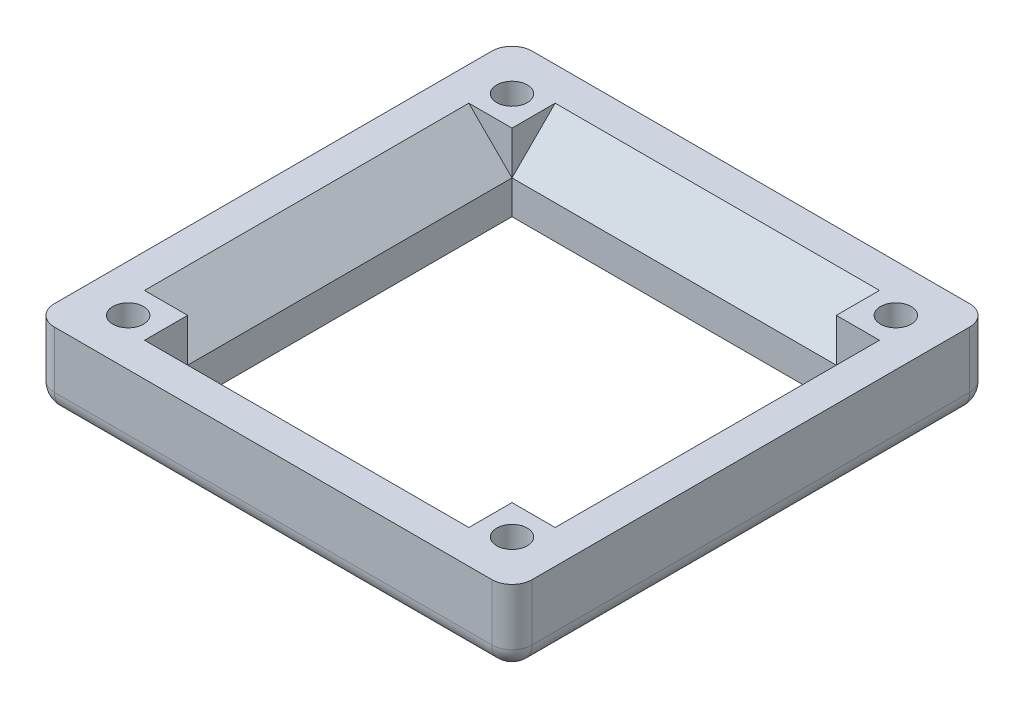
ISO-10303-21;
HEADER;
FILE_DESCRIPTION(('STEP AP214'),'2;1');
FILE_NAME('part.step','',(''),(''),'','','');
FILE_SCHEMA(('AUTOMOTIVE_DESIGN { 1 0 10303 214 1 1 1 1 }'));
ENDSEC;
DATA;
#1=APPLICATION_CONTEXT('core data for automotive mechanical design processes');
#2=APPLICATION_PROTOCOL_DEFINITION('international standard','automotive_design',2000,#1);
#3=PRODUCT_CONTEXT('',#1,'mechanical');
#4=PRODUCT('Part','Part','',(#3));
#5=PRODUCT_RELATED_PRODUCT_CATEGORY('part','',(#4));
#6=PRODUCT_DEFINITION_FORMATION('','',#4);
#7=PRODUCT_DEFINITION_CONTEXT('part definition',#1,'design');
#8=PRODUCT_DEFINITION('design','',#6,#7);
#9=PRODUCT_DEFINITION_SHAPE('','',#8);
#10=(LENGTH_UNIT() NAMED_UNIT(*) SI_UNIT(.MILLI.,.METRE.));
#11=(NAMED_UNIT(*) PLANE_ANGLE_UNIT() SI_UNIT($,.RADIAN.));
#12=(NAMED_UNIT(*) SI_UNIT($,.STERADIAN.) SOLID_ANGLE_UNIT());
#13=UNCERTAINTY_MEASURE_WITH_UNIT(LENGTH_MEASURE(1.E-05),#10,'distance_accuracy_value','');
#14=(GEOMETRIC_REPRESENTATION_CONTEXT(3) GLOBAL_UNCERTAINTY_ASSIGNED_CONTEXT((#13)) GLOBAL_UNIT_ASSIGNED_CONTEXT((#10,
#11,#12)) REPRESENTATION_CONTEXT('',''));
#15=CARTESIAN_POINT('',(0.,0.,0.));
#16=DIRECTION('',(0.,0.,1.));
#17=DIRECTION('',(1.,0.,0.));
#18=AXIS2_PLACEMENT_3D('',#15,#16,#17);
#19=CARTESIAN_POINT('',(0.,0.,0.));
#20=DIRECTION('',(0.,1.,0.));
#21=DIRECTION('',(0.,0.,1.));
#22=AXIS2_PLACEMENT_3D('',#19,#20,#21);
#23=PLANE('',#22);
#24=DIRECTION('',(1.,0.,0.));
#25=VECTOR('',#24,1.);
#26=CARTESIAN_POINT('',(-16.9000000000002,0.,16.9));
#27=LINE('',#26,#25);
#28=CARTESIAN_POINT('',(-16.9000000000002,0.,16.9));
#29=VERTEX_POINT('',#28);
#30=CARTESIAN_POINT('',(16.9000000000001,0.,16.9));
#31=VERTEX_POINT('',#30);
#32=EDGE_CURVE('E439',#29,#31,#27,.T.);
#33=ORIENTED_EDGE('',*,*,#32,.T.);
#34=DIRECTION('',(0.,0.,-1.));
#35=VECTOR('',#34,1.);
#36=CARTESIAN_POINT('',(16.9000000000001,0.,16.9));
#37=LINE('',#36,#35);
#38=CARTESIAN_POINT('',(16.9000000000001,0.,-16.9000000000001));
#39=VERTEX_POINT('',#38);
#40=EDGE_CURVE('E453',#31,#39,#37,.T.);
#41=ORIENTED_EDGE('',*,*,#40,.T.);
#42=DIRECTION('',(1.,0.,0.));
#43=VECTOR('',#42,1.);
#44=CARTESIAN_POINT('',(-16.9000000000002,0.,-16.9000000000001));
#45=LINE('',#44,#43);
#46=CARTESIAN_POINT('',(-16.9000000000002,0.,-16.9000000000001));
#47=VERTEX_POINT('',#46);
#48=EDGE_CURVE('E457',#47,#39,#45,.T.);
#49=ORIENTED_EDGE('',*,*,#48,.F.);
#50=DIRECTION('',(0.,0.,-1.));
#51=VECTOR('',#50,1.);
#52=CARTESIAN_POINT('',(-16.9000000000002,0.,16.9));
#53=LINE('',#52,#51);
#54=EDGE_CURVE('E461',#29,#47,#53,.T.);
#55=ORIENTED_EDGE('',*,*,#54,.F.);
#56=EDGE_LOOP('',(#33,#41,#49,#55));
#57=FACE_BOUND('',#56,.T.);
#58=CARTESIAN_POINT('',(20.,0.,20.));
#59=DIRECTION('',(0.,1.,0.));
#60=DIRECTION('',(0.,0.,1.));
#61=AXIS2_PLACEMENT_3D('',#58,#59,#60);
#62=CIRCLE('',#61,2.8);
#63=CARTESIAN_POINT('',(22.8,0.,20.));
#64=VERTEX_POINT('',#63);
#65=CARTESIAN_POINT('',(20.,0.,22.8));
#66=VERTEX_POINT('',#65);
#67=EDGE_CURVE('E390',#64,#66,#62,.T.);
#68=ORIENTED_EDGE('',*,*,#67,.T.);
#69=DIRECTION('',(1.,0.,0.));
#70=VECTOR('',#69,1.);
#71=CARTESIAN_POINT('',(0.,0.,22.8));
#72=LINE('',#71,#70);
#73=CARTESIAN_POINT('',(-20.,0.,22.8));
#74=VERTEX_POINT('',#73);
#75=EDGE_CURVE('E542',#66,#74,#72,.F.);
#76=ORIENTED_EDGE('',*,*,#75,.T.);
#77=CARTESIAN_POINT('',(-20.,0.,20.));
#78=DIRECTION('',(0.,1.,0.));
#79=DIRECTION('',(0.,0.,1.));
#80=AXIS2_PLACEMENT_3D('',#77,#78,#79);
#81=CIRCLE('',#80,2.8);
#82=CARTESIAN_POINT('',(-22.8,0.,20.));
#83=VERTEX_POINT('',#82);
#84=EDGE_CURVE('E405',#74,#83,#81,.T.);
#85=ORIENTED_EDGE('',*,*,#84,.T.);
#86=DIRECTION('',(0.,0.,-1.));
#87=VECTOR('',#86,1.);
#88=CARTESIAN_POINT('',(-22.8,0.,-24.9));
#89=LINE('',#88,#87);
#90=CARTESIAN_POINT('',(-22.8,0.,-20.));
#91=VERTEX_POINT('',#90);
#92=EDGE_CURVE('E531',#83,#91,#89,.T.);
#93=ORIENTED_EDGE('',*,*,#92,.T.);
#94=CARTESIAN_POINT('',(-20.,0.,-20.));
#95=DIRECTION('',(0.,1.,0.));
#96=DIRECTION('',(0.,0.,1.));
#97=AXIS2_PLACEMENT_3D('',#94,#95,#96);
#98=CIRCLE('',#97,2.8);
#99=CARTESIAN_POINT('',(-20.,0.,-22.8));
#100=VERTEX_POINT('',#99);
#101=EDGE_CURVE('E400',#91,#100,#98,.T.);
#102=ORIENTED_EDGE('',*,*,#101,.T.);
#103=DIRECTION('',(1.,0.,0.));
#104=VECTOR('',#103,1.);
#105=CARTESIAN_POINT('',(24.9,0.,-22.8));
#106=LINE('',#105,#104);
#107=CARTESIAN_POINT('',(20.,0.,-22.8));
#108=VERTEX_POINT('',#107);
#109=EDGE_CURVE('E521',#100,#108,#106,.T.);
#110=ORIENTED_EDGE('',*,*,#109,.T.);
#111=CARTESIAN_POINT('',(20.,0.,-20.));
#112=DIRECTION('',(0.,1.,0.));
#113=DIRECTION('',(0.,0.,1.));
#114=AXIS2_PLACEMENT_3D('',#111,#112,#113);
#115=CIRCLE('',#114,2.8);
#116=CARTESIAN_POINT('',(22.8,0.,-20.));
#117=VERTEX_POINT('',#116);
#118=EDGE_CURVE('E391',#108,#117,#115,.T.);
#119=ORIENTED_EDGE('',*,*,#118,.T.);
#120=DIRECTION('',(0.,0.,-1.));
#121=VECTOR('',#120,1.);
#122=CARTESIAN_POINT('',(22.8,0.,0.));
#123=LINE('',#122,#121);
#124=EDGE_CURVE('E508',#117,#64,#123,.F.);
#125=ORIENTED_EDGE('',*,*,#124,.T.);
#126=EDGE_LOOP('',(#68,#76,#85,#93,#102,#110,#119,#125));
#127=FACE_BOUND('',#126,.T.);
#128=ADVANCED_FACE('F124',(#57,#127),#23,.F.);
#129=EDGE_CURVE('E409',#83,#74,#81,.T.);
#130=ORIENTED_EDGE('',*,*,#129,.T.);
#131=DIRECTION('',(1.,0.,0.));
#132=VECTOR('',#131,1.);
#133=CARTESIAN_POINT('',(0.,0.,22.8));
#134=LINE('',#133,#132);
#135=CARTESIAN_POINT('',(-22.8,0.,22.8));
#136=VERTEX_POINT('',#135);
#137=EDGE_CURVE('E538',#74,#136,#134,.F.);
#138=ORIENTED_EDGE('',*,*,#137,.T.);
#139=DIRECTION('',(0.,0.,-1.));
#140=VECTOR('',#139,1.);
#141=CARTESIAN_POINT('',(-22.8,0.,-24.9));
#142=LINE('',#141,#140);
#143=EDGE_CURVE('E534',#136,#83,#142,.T.);
#144=ORIENTED_EDGE('',*,*,#143,.T.);
#145=EDGE_LOOP('',(#130,#138,#144));
#146=FACE_BOUND('',#145,.T.);
#147=ADVANCED_FACE('F735',(#146),#23,.F.);
#148=EDGE_CURVE('E396',#100,#91,#98,.T.);
#149=ORIENTED_EDGE('',*,*,#148,.T.);
#150=DIRECTION('',(0.,0.,-1.));
#151=VECTOR('',#150,1.);
#152=CARTESIAN_POINT('',(-22.8,0.,-24.9));
#153=LINE('',#152,#151);
#154=CARTESIAN_POINT('',(-22.8,0.,-22.8));
#155=VERTEX_POINT('',#154);
#156=EDGE_CURVE('E527',#91,#155,#153,.T.);
#157=ORIENTED_EDGE('',*,*,#156,.T.);
#158=DIRECTION('',(1.,0.,0.));
#159=VECTOR('',#158,1.);
#160=CARTESIAN_POINT('',(24.9,0.,-22.8));
#161=LINE('',#160,#159);
#162=EDGE_CURVE('E524',#155,#100,#161,.T.);
#163=ORIENTED_EDGE('',*,*,#162,.T.);
#164=EDGE_LOOP('',(#149,#157,#163));
#165=FACE_BOUND('',#164,.T.);
#166=ADVANCED_FACE('F660',(#165),#23,.F.);
#167=EDGE_CURVE('E386',#117,#108,#115,.T.);
#168=ORIENTED_EDGE('',*,*,#167,.T.);
#169=DIRECTION('',(1.,0.,0.));
#170=VECTOR('',#169,1.);
#171=CARTESIAN_POINT('',(24.9,0.,-22.8));
#172=LINE('',#171,#170);
#173=CARTESIAN_POINT('',(22.8,0.,-22.8));
#174=VERTEX_POINT('',#173);
#175=EDGE_CURVE('E517',#108,#174,#172,.T.);
#176=ORIENTED_EDGE('',*,*,#175,.T.);
#177=DIRECTION('',(0.,0.,-1.));
#178=VECTOR('',#177,1.);
#179=CARTESIAN_POINT('',(22.8,0.,0.));
#180=LINE('',#179,#178);
#181=EDGE_CURVE('E511',#174,#117,#180,.F.);
#182=ORIENTED_EDGE('',*,*,#181,.T.);
#183=EDGE_LOOP('',(#168,#176,#182));
#184=FACE_BOUND('',#183,.T.);
#185=ADVANCED_FACE('F678',(#184),#23,.F.);
#186=CARTESIAN_POINT('',(0.,8.,0.));
#187=DIRECTION('',(0.,1.,0.));
#188=DIRECTION('',(0.,0.,1.));
#189=AXIS2_PLACEMENT_3D('',#186,#187,#188);
#190=PLANE('',#189);
#191=DIRECTION('',(0.,0.,-1.));
#192=VECTOR('',#191,1.);
#193=CARTESIAN_POINT('',(-16.9000000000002,8.,16.9));
#194=LINE('',#193,#192);
#195=CARTESIAN_POINT('',(-16.9000000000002,8.,21.3971991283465));
#196=VERTEX_POINT('',#195);
#197=CARTESIAN_POINT('',(-16.9000000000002,8.,16.9));
#198=VERTEX_POINT('',#197);
#199=EDGE_CURVE('E288',#196,#198,#194,.T.);
#200=ORIENTED_EDGE('',*,*,#199,.T.);
#201=DIRECTION('',(1.,0.,0.));
#202=VECTOR('',#201,1.);
#203=CARTESIAN_POINT('',(-16.9000000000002,8.,16.9));
#204=LINE('',#203,#202);
#205=CARTESIAN_POINT('',(-21.3971991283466,8.,16.9));
#206=VERTEX_POINT('',#205);
#207=EDGE_CURVE('E440',#206,#198,#204,.T.);
#208=ORIENTED_EDGE('',*,*,#207,.F.);
#209=DIRECTION('',(0.,0.,-1.));
#210=VECTOR('',#209,1.);
#211=CARTESIAN_POINT('',(-21.3971991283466,8.,23.2600000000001));
#212=LINE('',#211,#210);
#213=CARTESIAN_POINT('',(-21.3971991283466,8.,-16.9000000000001));
#214=VERTEX_POINT('',#213);
#215=EDGE_CURVE('E360',#206,#214,#212,.T.);
#216=ORIENTED_EDGE('',*,*,#215,.T.);
#217=DIRECTION('',(1.,0.,0.));
#218=VECTOR('',#217,1.);
#219=CARTESIAN_POINT('',(-16.9000000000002,8.,-16.9000000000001));
#220=LINE('',#219,#218);
#221=CARTESIAN_POINT('',(-16.9000000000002,7.99999999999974,-16.9000000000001));
#222=VERTEX_POINT('',#221);
#223=EDGE_CURVE('E445',#214,#222,#220,.T.);
#224=ORIENTED_EDGE('',*,*,#223,.T.);
#225=DIRECTION('',(0.,0.,-1.));
#226=VECTOR('',#225,1.);
#227=CARTESIAN_POINT('',(-16.9000000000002,8.,16.9));
#228=LINE('',#227,#226);
#229=CARTESIAN_POINT('',(-16.9000000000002,7.99999999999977,-21.3971991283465));
#230=VERTEX_POINT('',#229);
#231=EDGE_CURVE('E334',#222,#230,#228,.T.);
#232=ORIENTED_EDGE('',*,*,#231,.T.);
#233=DIRECTION('',(-1.,0.,0.));
#234=VECTOR('',#233,1.);
#235=CARTESIAN_POINT('',(23.2600000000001,7.99999999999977,-21.3971991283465));
#236=LINE('',#235,#234);
#237=CARTESIAN_POINT('',(16.9000000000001,7.99999999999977,-21.3971991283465));
#238=VERTEX_POINT('',#237);
#239=EDGE_CURVE('E346',#238,#230,#236,.T.);
#240=ORIENTED_EDGE('',*,*,#239,.F.);
#241=DIRECTION('',(0.,0.,1.));
#242=VECTOR('',#241,1.);
#243=CARTESIAN_POINT('',(16.9000000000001,8.,16.9));
#244=LINE('',#243,#242);
#245=CARTESIAN_POINT('',(16.9000000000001,7.99999999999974,-16.9000000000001));
#246=VERTEX_POINT('',#245);
#247=EDGE_CURVE('E329',#238,#246,#244,.T.);
#248=ORIENTED_EDGE('',*,*,#247,.T.);
#249=CARTESIAN_POINT('',(21.3971991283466,8.00000000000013,-16.9000000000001));
#250=VERTEX_POINT('',#249);
#251=EDGE_CURVE('E443',#246,#250,#220,.T.);
#252=ORIENTED_EDGE('',*,*,#251,.T.);
#253=DIRECTION('',(0.,0.,-1.));
#254=VECTOR('',#253,1.);
#255=CARTESIAN_POINT('',(21.3971991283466,8.00000000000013,23.2600000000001));
#256=LINE('',#255,#254);
#257=CARTESIAN_POINT('',(21.3971991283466,8.00000000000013,16.9));
#258=VERTEX_POINT('',#257);
#259=EDGE_CURVE('E375',#258,#250,#256,.T.);
#260=ORIENTED_EDGE('',*,*,#259,.F.);
#261=CARTESIAN_POINT('',(16.9000000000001,8.,16.9));
#262=VERTEX_POINT('',#261);
#263=EDGE_CURVE('E444',#262,#258,#204,.T.);
#264=ORIENTED_EDGE('',*,*,#263,.F.);
#265=DIRECTION('',(0.,0.,1.));
#266=VECTOR('',#265,1.);
#267=CARTESIAN_POINT('',(16.9000000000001,8.,16.9));
#268=LINE('',#267,#266);
#269=CARTESIAN_POINT('',(16.9000000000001,8.,21.3971991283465));
#270=VERTEX_POINT('',#269);
#271=EDGE_CURVE('E312',#262,#270,#268,.T.);
#272=ORIENTED_EDGE('',*,*,#271,.T.);
#273=DIRECTION('',(-1.,0.,0.));
#274=VECTOR('',#273,1.);
#275=CARTESIAN_POINT('',(23.2600000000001,8.,21.3971991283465));
#276=LINE('',#275,#274);
#277=EDGE_CURVE('E302',#270,#196,#276,.T.);
#278=ORIENTED_EDGE('',*,*,#277,.T.);
#279=EDGE_LOOP('',(#200,#208,#216,#224,#232,#240,#248,#252,#260,#264,#272,#278));
#280=FACE_BOUND('',#279,.T.);
#281=CARTESIAN_POINT('',(20.,8.,20.));
#282=DIRECTION('',(0.,1.,0.));
#283=DIRECTION('',(0.,0.,1.));
#284=AXIS2_PLACEMENT_3D('',#281,#282,#283);
#285=CIRCLE('',#284,1.6);
#286=CARTESIAN_POINT('',(20.,8.,21.6));
#287=VERTEX_POINT('',#286);
#288=EDGE_CURVE('E426',#287,#287,#285,.T.);
#289=ORIENTED_EDGE('',*,*,#288,.F.);
#290=EDGE_LOOP('',(#289));
#291=FACE_BOUND('',#290,.T.);
#292=CARTESIAN_POINT('',(-20.,8.,-20.));
#293=DIRECTION('',(0.,1.,0.));
#294=DIRECTION('',(0.,0.,1.));
#295=AXIS2_PLACEMENT_3D('',#292,#293,#294);
#296=CIRCLE('',#295,1.6);
#297=CARTESIAN_POINT('',(-20.,8.,-18.4));
#298=VERTEX_POINT('',#297);
#299=EDGE_CURVE('E435',#298,#298,#296,.T.);
#300=ORIENTED_EDGE('',*,*,#299,.F.);
#301=EDGE_LOOP('',(#300));
#302=FACE_BOUND('',#301,.T.);
#303=DIRECTION('',(1.,0.,0.));
#304=VECTOR('',#303,1.);
#305=CARTESIAN_POINT('',(-24.9,8.,-24.9));
#306=LINE('',#305,#304);
#307=CARTESIAN_POINT('',(-22.8,8.,-24.9));
#308=VERTEX_POINT('',#307);
#309=CARTESIAN_POINT('',(22.8,8.,-24.9));
#310=VERTEX_POINT('',#309);
#311=EDGE_CURVE('E482',#308,#310,#306,.T.);
#312=ORIENTED_EDGE('',*,*,#311,.F.);
#313=CARTESIAN_POINT('',(-22.8,8.,-22.8));
#314=DIRECTION('',(0.,1.,0.));
#315=DIRECTION('',(0.,0.,1.));
#316=AXIS2_PLACEMENT_3D('',#313,#314,#315);
#317=CIRCLE('',#316,2.1);
#318=CARTESIAN_POINT('',(-24.9,8.,-22.8));
#319=VERTEX_POINT('',#318);
#320=EDGE_CURVE('E608',#308,#319,#317,.T.);
#321=ORIENTED_EDGE('',*,*,#320,.T.);
#322=DIRECTION('',(0.,0.,-1.));
#323=VECTOR('',#322,1.);
#324=CARTESIAN_POINT('',(-24.9,8.,24.9));
#325=LINE('',#324,#323);
#326=CARTESIAN_POINT('',(-24.9,8.,22.8));
#327=VERTEX_POINT('',#326);
#328=EDGE_CURVE('E486',#327,#319,#325,.T.);
#329=ORIENTED_EDGE('',*,*,#328,.F.);
#330=CARTESIAN_POINT('',(-22.8,8.,22.8));
#331=DIRECTION('',(0.,1.,0.));
#332=DIRECTION('',(0.,0.,1.));
#333=AXIS2_PLACEMENT_3D('',#330,#331,#332);
#334=CIRCLE('',#333,2.1);
#335=CARTESIAN_POINT('',(-22.8,8.,24.9));
#336=VERTEX_POINT('',#335);
#337=EDGE_CURVE('E605',#327,#336,#334,.T.);
#338=ORIENTED_EDGE('',*,*,#337,.T.);
#339=DIRECTION('',(1.,0.,0.));
#340=VECTOR('',#339,1.);
#341=CARTESIAN_POINT('',(-24.9,8.,24.9));
#342=LINE('',#341,#340);
#343=CARTESIAN_POINT('',(22.8,8.,24.9));
#344=VERTEX_POINT('',#343);
#345=EDGE_CURVE('E476',#336,#344,#342,.T.);
#346=ORIENTED_EDGE('',*,*,#345,.T.);
#347=CARTESIAN_POINT('',(22.8,8.,22.8));
#348=DIRECTION('',(0.,1.,0.));
#349=DIRECTION('',(0.,0.,1.));
#350=AXIS2_PLACEMENT_3D('',#347,#348,#349);
#351=CIRCLE('',#350,2.1);
#352=CARTESIAN_POINT('',(24.9,8.,22.8));
#353=VERTEX_POINT('',#352);
#354=EDGE_CURVE('E148',#344,#353,#351,.T.);
#355=ORIENTED_EDGE('',*,*,#354,.T.);
#356=DIRECTION('',(0.,0.,-1.));
#357=VECTOR('',#356,1.);
#358=CARTESIAN_POINT('',(24.9,8.,24.9));
#359=LINE('',#358,#357);
#360=CARTESIAN_POINT('',(24.9,8.,-22.8));
#361=VERTEX_POINT('',#360);
#362=EDGE_CURVE('E479',#353,#361,#359,.T.);
#363=ORIENTED_EDGE('',*,*,#362,.T.);
#364=CARTESIAN_POINT('',(22.8,8.,-22.8));
#365=DIRECTION('',(0.,1.,0.));
#366=DIRECTION('',(0.,0.,1.));
#367=AXIS2_PLACEMENT_3D('',#364,#365,#366);
#368=CIRCLE('',#367,2.1);
#369=EDGE_CURVE('E600',#361,#310,#368,.T.);
#370=ORIENTED_EDGE('',*,*,#369,.T.);
#371=EDGE_LOOP('',(#312,#321,#329,#338,#346,#355,#363,#370));
#372=FACE_BOUND('',#371,.T.);
#373=CARTESIAN_POINT('',(20.,8.,-20.));
#374=DIRECTION('',(0.,1.,0.));
#375=DIRECTION('',(0.,0.,1.));
#376=AXIS2_PLACEMENT_3D('',#373,#374,#375);
#377=CIRCLE('',#376,1.6);
#378=CARTESIAN_POINT('',(20.,8.,-18.4));
#379=VERTEX_POINT('',#378);
#380=EDGE_CURVE('E431',#379,#379,#377,.T.);
#381=ORIENTED_EDGE('',*,*,#380,.F.);
#382=EDGE_LOOP('',(#381));
#383=FACE_BOUND('',#382,.T.);
#384=CARTESIAN_POINT('',(-20.,8.,20.));
#385=DIRECTION('',(0.,1.,0.));
#386=DIRECTION('',(0.,0.,1.));
#387=AXIS2_PLACEMENT_3D('',#384,#385,#386);
#388=CIRCLE('',#387,1.6);
#389=CARTESIAN_POINT('',(-20.,8.,21.6));
#390=VERTEX_POINT('',#389);
#391=EDGE_CURVE('E422',#390,#390,#388,.T.);
#392=ORIENTED_EDGE('',*,*,#391,.F.);
#393=EDGE_LOOP('',(#392));
#394=FACE_BOUND('',#393,.T.);
#395=ADVANCED_FACE('F309',(#280,#291,#302,#372,#383,#394),#190,.T.);
#396=CARTESIAN_POINT('',(-16.9000000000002,8.,16.9));
#397=DIRECTION('',(0.,0.,-1.));
#398=DIRECTION('',(-1.,0.,0.));
#399=AXIS2_PLACEMENT_3D('',#396,#397,#398);
#400=PLANE('',#399);
#401=DIRECTION('',(0.,-1.,0.));
#402=VECTOR('',#401,1.);
#403=CARTESIAN_POINT('',(-16.9000000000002,8.,16.9));
#404=LINE('',#403,#402);
#405=CARTESIAN_POINT('',(-16.9000000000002,3.50280087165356,16.9));
#406=VERTEX_POINT('',#405);
#407=EDGE_CURVE('E293',#198,#406,#404,.T.);
#408=ORIENTED_EDGE('',*,*,#407,.T.);
#409=DIRECTION('',(0.707106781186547,-0.707106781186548,0.));
#410=VECTOR('',#409,1.);
#411=CARTESIAN_POINT('',(-19.1485995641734,5.75140043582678,16.9));
#412=LINE('',#411,#410);
#413=EDGE_CURVE('E364',#206,#406,#412,.T.);
#414=ORIENTED_EDGE('',*,*,#413,.F.);
#415=ORIENTED_EDGE('',*,*,#207,.T.);
#416=EDGE_LOOP('',(#408,#414,#415));
#417=FACE_BOUND('',#416,.T.);
#418=ADVANCED_FACE('F729',(#417),#400,.T.);
#419=DIRECTION('',(0.707106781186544,0.707106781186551,0.));
#420=VECTOR('',#419,1.);
#421=CARTESIAN_POINT('',(2.24859956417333,-11.1485995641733,16.9));
#422=LINE('',#421,#420);
#423=CARTESIAN_POINT('',(16.9000000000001,3.50280087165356,16.9));
#424=VERTEX_POINT('',#423);
#425=EDGE_CURVE('E359',#424,#258,#422,.T.);
#426=ORIENTED_EDGE('',*,*,#425,.F.);
#427=DIRECTION('',(0.,1.,0.));
#428=VECTOR('',#427,1.);
#429=CARTESIAN_POINT('',(16.9000000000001,8.,16.9));
#430=LINE('',#429,#428);
#431=EDGE_CURVE('E317',#424,#262,#430,.T.);
#432=ORIENTED_EDGE('',*,*,#431,.T.);
#433=ORIENTED_EDGE('',*,*,#263,.T.);
#434=EDGE_LOOP('',(#426,#432,#433));
#435=FACE_BOUND('',#434,.T.);
#436=ADVANCED_FACE('F730',(#435),#400,.T.);
#437=CARTESIAN_POINT('',(-16.9000000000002,8.,-16.9000000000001));
#438=DIRECTION('',(0.,0.,-1.));
#439=DIRECTION('',(-1.,0.,0.));
#440=AXIS2_PLACEMENT_3D('',#437,#438,#439);
#441=PLANE('',#440);
#442=DIRECTION('',(0.,1.,0.));
#443=VECTOR('',#442,1.);
#444=CARTESIAN_POINT('',(-16.9000000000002,7.99999999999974,-16.9000000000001));
#445=LINE('',#444,#443);
#446=CARTESIAN_POINT('',(-16.9000000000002,3.50280087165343,-16.9000000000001));
#447=VERTEX_POINT('',#446);
#448=EDGE_CURVE('E342',#447,#222,#445,.T.);
#449=ORIENTED_EDGE('',*,*,#448,.T.);
#450=ORIENTED_EDGE('',*,*,#223,.F.);
#451=DIRECTION('',(-0.707106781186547,0.707106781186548,0.));
#452=VECTOR('',#451,1.);
#453=CARTESIAN_POINT('',(-19.1485995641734,5.75140043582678,-16.9000000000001));
#454=LINE('',#453,#452);
#455=EDGE_CURVE('E354',#447,#214,#454,.T.);
#456=ORIENTED_EDGE('',*,*,#455,.F.);
#457=EDGE_LOOP('',(#449,#450,#456));
#458=FACE_BOUND('',#457,.T.);
#459=ADVANCED_FACE('F752',(#458),#441,.F.);
#460=DIRECTION('',(0.,-1.,0.));
#461=VECTOR('',#460,1.);
#462=CARTESIAN_POINT('',(16.9000000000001,7.99999999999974,-16.9000000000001));
#463=LINE('',#462,#461);
#464=CARTESIAN_POINT('',(16.9000000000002,3.50280087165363,-16.9000000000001));
#465=VERTEX_POINT('',#464);
#466=EDGE_CURVE('E325',#246,#465,#463,.T.);
#467=ORIENTED_EDGE('',*,*,#466,.T.);
#468=DIRECTION('',(-0.707106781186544,-0.707106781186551,0.));
#469=VECTOR('',#468,1.);
#470=CARTESIAN_POINT('',(2.24859956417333,-11.1485995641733,-16.9000000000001));
#471=LINE('',#470,#469);
#472=EDGE_CURVE('E323',#250,#465,#471,.T.);
#473=ORIENTED_EDGE('',*,*,#472,.F.);
#474=ORIENTED_EDGE('',*,*,#251,.F.);
#475=EDGE_LOOP('',(#467,#473,#474));
#476=FACE_BOUND('',#475,.T.);
#477=ADVANCED_FACE('F745',(#476),#441,.F.);
#478=DIRECTION('',(0.,0.,-1.));
#479=VECTOR('',#478,1.);
#480=CARTESIAN_POINT('',(22.8,0.,0.));
#481=LINE('',#480,#479);
#482=CARTESIAN_POINT('',(22.8,0.,22.8));
#483=VERTEX_POINT('',#482);
#484=EDGE_CURVE('E490',#64,#483,#481,.F.);
#485=ORIENTED_EDGE('',*,*,#484,.T.);
#486=DIRECTION('',(1.,0.,0.));
#487=VECTOR('',#486,1.);
#488=CARTESIAN_POINT('',(0.,0.,22.8));
#489=LINE('',#488,#487);
#490=EDGE_CURVE('E514',#483,#66,#489,.F.);
#491=ORIENTED_EDGE('',*,*,#490,.T.);
#492=EDGE_CURVE('E418',#66,#64,#62,.T.);
#493=ORIENTED_EDGE('',*,*,#492,.T.);
#494=EDGE_LOOP('',(#485,#491,#493));
#495=FACE_BOUND('',#494,.T.);
#496=ADVANCED_FACE('F691',(#495),#23,.F.);
#497=CARTESIAN_POINT('',(-24.9,8.,24.9));
#498=DIRECTION('',(0.,0.,-1.));
#499=DIRECTION('',(-1.,0.,0.));
#500=AXIS2_PLACEMENT_3D('',#497,#498,#499);
#501=PLANE('',#500);
#502=ORIENTED_EDGE('',*,*,#345,.F.);
#503=DIRECTION('',(0.,-1.,0.));
#504=VECTOR('',#503,1.);
#505=CARTESIAN_POINT('',(-22.8,2.1,24.9));
#506=LINE('',#505,#504);
#507=CARTESIAN_POINT('',(-22.8,2.1,24.9));
#508=VERTEX_POINT('',#507);
#509=EDGE_CURVE('E614',#336,#508,#506,.T.);
#510=ORIENTED_EDGE('',*,*,#509,.T.);
#511=DIRECTION('',(1.,0.,0.));
#512=VECTOR('',#511,1.);
#513=CARTESIAN_POINT('',(-24.9,2.1,24.9));
#514=LINE('',#513,#512);
#515=CARTESIAN_POINT('',(22.8,2.1,24.9));
#516=VERTEX_POINT('',#515);
#517=EDGE_CURVE('E553',#508,#516,#514,.T.);
#518=ORIENTED_EDGE('',*,*,#517,.T.);
#519=DIRECTION('',(0.,-1.,0.));
#520=VECTOR('',#519,1.);
#521=CARTESIAN_POINT('',(22.8,8.,24.9));
#522=LINE('',#521,#520);
#523=EDGE_CURVE('E611',#516,#344,#522,.F.);
#524=ORIENTED_EDGE('',*,*,#523,.T.);
#525=EDGE_LOOP('',(#502,#510,#518,#524));
#526=FACE_BOUND('',#525,.T.);
#527=ADVANCED_FACE('F703',(#526),#501,.F.);
#528=CARTESIAN_POINT('',(24.9,8.,24.9));
#529=DIRECTION('',(-1.,0.,0.));
#530=DIRECTION('',(0.,0.,1.));
#531=AXIS2_PLACEMENT_3D('',#528,#529,#530);
#532=PLANE('',#531);
#533=ORIENTED_EDGE('',*,*,#362,.F.);
#534=DIRECTION('',(0.,-1.,0.));
#535=VECTOR('',#534,1.);
#536=CARTESIAN_POINT('',(24.9,8.,22.8));
#537=LINE('',#536,#535);
#538=CARTESIAN_POINT('',(24.9,2.1,22.8));
#539=VERTEX_POINT('',#538);
#540=EDGE_CURVE('E12',#353,#539,#537,.T.);
#541=ORIENTED_EDGE('',*,*,#540,.T.);
#542=DIRECTION('',(0.,0.,-1.));
#543=VECTOR('',#542,1.);
#544=CARTESIAN_POINT('',(24.9,2.1,24.9));
#545=LINE('',#544,#543);
#546=CARTESIAN_POINT('',(24.9,2.1,-22.8));
#547=VERTEX_POINT('',#546);
#548=EDGE_CURVE('E557',#539,#547,#545,.T.);
#549=ORIENTED_EDGE('',*,*,#548,.T.);
#550=DIRECTION('',(0.,-1.,0.));
#551=VECTOR('',#550,1.);
#552=CARTESIAN_POINT('',(24.9,8.,-22.8));
#553=LINE('',#552,#551);
#554=EDGE_CURVE('E134',#547,#361,#553,.F.);
#555=ORIENTED_EDGE('',*,*,#554,.T.);
#556=EDGE_LOOP('',(#533,#541,#549,#555));
#557=FACE_BOUND('',#556,.T.);
#558=ADVANCED_FACE('F731',(#557),#532,.F.);
#559=CARTESIAN_POINT('',(-24.9,8.,-24.9));
#560=DIRECTION('',(0.,0.,-1.));
#561=DIRECTION('',(-1.,0.,0.));
#562=AXIS2_PLACEMENT_3D('',#559,#560,#561);
#563=PLANE('',#562);
#564=DIRECTION('',(1.,0.,0.));
#565=VECTOR('',#564,1.);
#566=CARTESIAN_POINT('',(-24.9,2.1,-24.9));
#567=LINE('',#566,#565);
#568=CARTESIAN_POINT('',(22.8,2.1,-24.9));
#569=VERTEX_POINT('',#568);
#570=CARTESIAN_POINT('',(-22.8,2.1,-24.9));
#571=VERTEX_POINT('',#570);
#572=EDGE_CURVE('E549',#569,#571,#567,.F.);
#573=ORIENTED_EDGE('',*,*,#572,.T.);
#574=DIRECTION('',(0.,-1.,0.));
#575=VECTOR('',#574,1.);
#576=CARTESIAN_POINT('',(-22.8,8.,-24.9));
#577=LINE('',#576,#575);
#578=EDGE_CURVE('E597',#571,#308,#577,.F.);
#579=ORIENTED_EDGE('',*,*,#578,.T.);
#580=ORIENTED_EDGE('',*,*,#311,.T.);
#581=DIRECTION('',(0.,-1.,0.));
#582=VECTOR('',#581,1.);
#583=CARTESIAN_POINT('',(22.8,2.1,-24.9));
#584=LINE('',#583,#582);
#585=EDGE_CURVE('E594',#310,#569,#584,.T.);
#586=ORIENTED_EDGE('',*,*,#585,.T.);
#587=EDGE_LOOP('',(#573,#579,#580,#586));
#588=FACE_BOUND('',#587,.T.);
#589=ADVANCED_FACE('F644',(#588),#563,.T.);
#590=CARTESIAN_POINT('',(-24.9,8.,24.9));
#591=DIRECTION('',(-1.,0.,0.));
#592=DIRECTION('',(0.,0.,1.));
#593=AXIS2_PLACEMENT_3D('',#590,#591,#592);
#594=PLANE('',#593);
#595=ORIENTED_EDGE('',*,*,#328,.T.);
#596=DIRECTION('',(0.,-1.,0.));
#597=VECTOR('',#596,1.);
#598=CARTESIAN_POINT('',(-24.9,8.,-22.8));
#599=LINE('',#598,#597);
#600=CARTESIAN_POINT('',(-24.9,2.1,-22.8));
#601=VERTEX_POINT('',#600);
#602=EDGE_CURVE('E591',#319,#601,#599,.T.);
#603=ORIENTED_EDGE('',*,*,#602,.T.);
#604=DIRECTION('',(0.,0.,-1.));
#605=VECTOR('',#604,1.);
#606=CARTESIAN_POINT('',(-24.9,2.1,24.9));
#607=LINE('',#606,#605);
#608=CARTESIAN_POINT('',(-24.9,2.1,22.8));
#609=VERTEX_POINT('',#608);
#610=EDGE_CURVE('E545',#601,#609,#607,.F.);
#611=ORIENTED_EDGE('',*,*,#610,.T.);
#612=DIRECTION('',(0.,-1.,0.));
#613=VECTOR('',#612,1.);
#614=CARTESIAN_POINT('',(-24.9,8.,22.8));
#615=LINE('',#614,#613);
#616=EDGE_CURVE('E588',#609,#327,#615,.F.);
#617=ORIENTED_EDGE('',*,*,#616,.T.);
#618=EDGE_LOOP('',(#595,#603,#611,#617));
#619=FACE_BOUND('',#618,.T.);
#620=ADVANCED_FACE('F717',(#619),#594,.T.);
#621=DIRECTION('',(-1.,0.,0.));
#622=VECTOR('',#621,1.);
#623=CARTESIAN_POINT('',(23.2600000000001,3.50280087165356,16.9));
#624=LINE('',#623,#622);
#625=EDGE_CURVE('E305',#424,#406,#624,.T.);
#626=ORIENTED_EDGE('',*,*,#625,.F.);
#627=DIRECTION('',(0.,-1.,0.));
#628=VECTOR('',#627,1.);
#629=CARTESIAN_POINT('',(16.9000000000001,8.,16.9));
#630=LINE('',#629,#628);
#631=EDGE_CURVE('E473',#424,#31,#630,.T.);
#632=ORIENTED_EDGE('',*,*,#631,.T.);
#633=ORIENTED_EDGE('',*,*,#32,.F.);
#634=DIRECTION('',(0.,-1.,0.));
#635=VECTOR('',#634,1.);
#636=CARTESIAN_POINT('',(-16.9000000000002,8.,16.9));
#637=LINE('',#636,#635);
#638=EDGE_CURVE('E449',#406,#29,#637,.T.);
#639=ORIENTED_EDGE('',*,*,#638,.F.);
#640=EDGE_LOOP('',(#626,#632,#633,#639));
#641=FACE_BOUND('',#640,.T.);
#642=ADVANCED_FACE('F719',(#641),#400,.T.);
#643=CARTESIAN_POINT('',(16.9000000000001,8.,16.9));
#644=DIRECTION('',(-1.,0.,0.));
#645=DIRECTION('',(0.,0.,1.));
#646=AXIS2_PLACEMENT_3D('',#643,#644,#645);
#647=PLANE('',#646);
#648=DIRECTION('',(0.,0.,-1.));
#649=VECTOR('',#648,1.);
#650=CARTESIAN_POINT('',(16.9000000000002,3.50280087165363,23.2600000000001));
#651=LINE('',#650,#649);
#652=EDGE_CURVE('E376',#424,#465,#651,.T.);
#653=ORIENTED_EDGE('',*,*,#652,.T.);
#654=DIRECTION('',(0.,-1.,0.));
#655=VECTOR('',#654,1.);
#656=CARTESIAN_POINT('',(16.9000000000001,8.,-16.9000000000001));
#657=LINE('',#656,#655);
#658=EDGE_CURVE('E470',#465,#39,#657,.T.);
#659=ORIENTED_EDGE('',*,*,#658,.T.);
#660=ORIENTED_EDGE('',*,*,#40,.F.);
#661=ORIENTED_EDGE('',*,*,#631,.F.);
#662=EDGE_LOOP('',(#653,#659,#660,#661));
#663=FACE_BOUND('',#662,.T.);
#664=ADVANCED_FACE('F726',(#663),#647,.T.);
#665=ORIENTED_EDGE('',*,*,#658,.F.);
#666=DIRECTION('',(-1.,0.,0.));
#667=VECTOR('',#666,1.);
#668=CARTESIAN_POINT('',(23.2600000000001,3.50280087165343,-16.9000000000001));
#669=LINE('',#668,#667);
#670=EDGE_CURVE('E330',#465,#447,#669,.T.);
#671=ORIENTED_EDGE('',*,*,#670,.T.);
#672=DIRECTION('',(0.,-1.,0.));
#673=VECTOR('',#672,1.);
#674=CARTESIAN_POINT('',(-16.9000000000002,8.,-16.9000000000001));
#675=LINE('',#674,#673);
#676=EDGE_CURVE('E467',#447,#47,#675,.T.);
#677=ORIENTED_EDGE('',*,*,#676,.T.);
#678=ORIENTED_EDGE('',*,*,#48,.T.);
#679=EDGE_LOOP('',(#665,#671,#677,#678));
#680=FACE_BOUND('',#679,.T.);
#681=ADVANCED_FACE('F755',(#680),#441,.F.);
#682=CARTESIAN_POINT('',(-16.9000000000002,8.,16.9));
#683=DIRECTION('',(-1.,0.,0.));
#684=DIRECTION('',(0.,0.,1.));
#685=AXIS2_PLACEMENT_3D('',#682,#683,#684);
#686=PLANE('',#685);
#687=ORIENTED_EDGE('',*,*,#676,.F.);
#688=DIRECTION('',(0.,0.,-1.));
#689=VECTOR('',#688,1.);
#690=CARTESIAN_POINT('',(-16.9000000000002,3.50280087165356,23.2600000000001));
#691=LINE('',#690,#689);
#692=EDGE_CURVE('E358',#406,#447,#691,.T.);
#693=ORIENTED_EDGE('',*,*,#692,.F.);
#694=ORIENTED_EDGE('',*,*,#638,.T.);
#695=ORIENTED_EDGE('',*,*,#54,.T.);
#696=EDGE_LOOP('',(#687,#693,#694,#695));
#697=FACE_BOUND('',#696,.T.);
#698=ADVANCED_FACE('F910',(#697),#686,.F.);
#699=CARTESIAN_POINT('',(-20.,8.,-20.));
#700=DIRECTION('',(0.,-1.,0.));
#701=DIRECTION('',(0.,0.,-1.));
#702=AXIS2_PLACEMENT_3D('',#699,#700,#701);
#703=CYLINDRICAL_SURFACE('',#702,1.6);
#704=CARTESIAN_POINT('',(-20.,2.45,-20.));
#705=DIRECTION('',(0.,1.,0.));
#706=DIRECTION('',(0.,0.,1.));
#707=AXIS2_PLACEMENT_3D('',#704,#705,#706);
#708=CIRCLE('',#707,1.6);
#709=CARTESIAN_POINT('',(-20.,2.45,-18.4));
#710=VERTEX_POINT('',#709);
#711=EDGE_CURVE('E427',#710,#710,#708,.T.);
#712=ORIENTED_EDGE('',*,*,#711,.F.);
#713=EDGE_LOOP('',(#712));
#714=FACE_BOUND('',#713,.T.);
#715=ORIENTED_EDGE('',*,*,#299,.T.);
#716=EDGE_LOOP('',(#715));
#717=FACE_BOUND('',#716,.T.);
#718=ADVANCED_FACE('F920',(#714,#717),#703,.F.);
#719=CARTESIAN_POINT('',(20.,8.,-20.));
#720=DIRECTION('',(0.,-1.,0.));
#721=DIRECTION('',(0.,0.,-1.));
#722=AXIS2_PLACEMENT_3D('',#719,#720,#721);
#723=CYLINDRICAL_SURFACE('',#722,1.6);
#724=CARTESIAN_POINT('',(20.,2.45,-20.));
#725=DIRECTION('',(0.,1.,0.));
#726=DIRECTION('',(0.,0.,1.));
#727=AXIS2_PLACEMENT_3D('',#724,#725,#726);
#728=CIRCLE('',#727,1.6);
#729=CARTESIAN_POINT('',(20.,2.45,-18.4));
#730=VERTEX_POINT('',#729);
#731=EDGE_CURVE('E498',#730,#730,#728,.T.);
#732=ORIENTED_EDGE('',*,*,#731,.F.);
#733=EDGE_LOOP('',(#732));
#734=FACE_BOUND('',#733,.T.);
#735=ORIENTED_EDGE('',*,*,#380,.T.);
#736=EDGE_LOOP('',(#735));
#737=FACE_BOUND('',#736,.T.);
#738=ADVANCED_FACE('F1011',(#734,#737),#723,.F.);
#739=CARTESIAN_POINT('',(20.,8.,20.));
#740=DIRECTION('',(0.,-1.,0.));
#741=DIRECTION('',(0.,0.,-1.));
#742=AXIS2_PLACEMENT_3D('',#739,#740,#741);
#743=CYLINDRICAL_SURFACE('',#742,1.6);
#744=CARTESIAN_POINT('',(20.,2.45,20.));
#745=DIRECTION('',(0.,1.,0.));
#746=DIRECTION('',(0.,0.,1.));
#747=AXIS2_PLACEMENT_3D('',#744,#745,#746);
#748=CIRCLE('',#747,1.6);
#749=CARTESIAN_POINT('',(20.,2.45,21.6));
#750=VERTEX_POINT('',#749);
#751=EDGE_CURVE('E494',#750,#750,#748,.T.);
#752=ORIENTED_EDGE('',*,*,#751,.F.);
#753=EDGE_LOOP('',(#752));
#754=FACE_BOUND('',#753,.T.);
#755=ORIENTED_EDGE('',*,*,#288,.T.);
#756=EDGE_LOOP('',(#755));
#757=FACE_BOUND('',#756,.T.);
#758=ADVANCED_FACE('F1008',(#754,#757),#743,.F.);
#759=CARTESIAN_POINT('',(-20.,8.,20.));
#760=DIRECTION('',(0.,-1.,0.));
#761=DIRECTION('',(0.,0.,-1.));
#762=AXIS2_PLACEMENT_3D('',#759,#760,#761);
#763=CYLINDRICAL_SURFACE('',#762,1.6);
#764=CARTESIAN_POINT('',(-20.,2.45,20.));
#765=DIRECTION('',(0.,1.,0.));
#766=DIRECTION('',(0.,0.,1.));
#767=AXIS2_PLACEMENT_3D('',#764,#765,#766);
#768=CIRCLE('',#767,1.6);
#769=CARTESIAN_POINT('',(-20.,2.45,21.6));
#770=VERTEX_POINT('',#769);
#771=EDGE_CURVE('E417',#770,#770,#768,.T.);
#772=ORIENTED_EDGE('',*,*,#771,.F.);
#773=EDGE_LOOP('',(#772));
#774=FACE_BOUND('',#773,.T.);
#775=ORIENTED_EDGE('',*,*,#391,.T.);
#776=EDGE_LOOP('',(#775));
#777=FACE_BOUND('',#776,.T.);
#778=ADVANCED_FACE('F804',(#774,#777),#763,.F.);
#779=CARTESIAN_POINT('',(-20.,2.45,20.));
#780=DIRECTION('',(0.,-1.,0.));
#781=DIRECTION('',(0.,0.,-1.));
#782=AXIS2_PLACEMENT_3D('',#779,#780,#781);
#783=CYLINDRICAL_SURFACE('',#782,2.8);
#784=CARTESIAN_POINT('',(-20.,2.45,20.));
#785=DIRECTION('',(0.,1.,0.));
#786=DIRECTION('',(0.,0.,1.));
#787=AXIS2_PLACEMENT_3D('',#784,#785,#786);
#788=CIRCLE('',#787,2.8);
#789=CARTESIAN_POINT('',(-20.,2.45,22.8));
#790=VERTEX_POINT('',#789);
#791=EDGE_CURVE('E371',#790,#790,#788,.T.);
#792=ORIENTED_EDGE('',*,*,#791,.T.);
#793=EDGE_LOOP('',(#792));
#794=FACE_BOUND('',#793,.T.);
#795=ORIENTED_EDGE('',*,*,#84,.F.);
#796=ORIENTED_EDGE('',*,*,#129,.F.);
#797=EDGE_LOOP('',(#795,#796));
#798=FACE_BOUND('',#797,.T.);
#799=ADVANCED_FACE('F801',(#794,#798),#783,.F.);
#800=CARTESIAN_POINT('',(-20.,2.45,20.));
#801=DIRECTION('',(0.,1.,0.));
#802=DIRECTION('',(0.,0.,1.));
#803=AXIS2_PLACEMENT_3D('',#800,#801,#802);
#804=PLANE('',#803);
#805=ORIENTED_EDGE('',*,*,#771,.T.);
#806=EDGE_LOOP('',(#805));
#807=FACE_BOUND('',#806,.T.);
#808=ORIENTED_EDGE('',*,*,#791,.F.);
#809=EDGE_LOOP('',(#808));
#810=FACE_BOUND('',#809,.T.);
#811=ADVANCED_FACE('F795',(#807,#810),#804,.F.);
#812=CARTESIAN_POINT('',(20.,2.45,20.));
#813=DIRECTION('',(0.,-1.,0.));
#814=DIRECTION('',(0.,0.,-1.));
#815=AXIS2_PLACEMENT_3D('',#812,#813,#814);
#816=CYLINDRICAL_SURFACE('',#815,2.8);
#817=CARTESIAN_POINT('',(20.,2.45,20.));
#818=DIRECTION('',(0.,1.,0.));
#819=DIRECTION('',(0.,0.,1.));
#820=AXIS2_PLACEMENT_3D('',#817,#818,#819);
#821=CIRCLE('',#820,2.8);
#822=CARTESIAN_POINT('',(20.,2.45,22.8));
#823=VERTEX_POINT('',#822);
#824=EDGE_CURVE('E413',#823,#823,#821,.T.);
#825=ORIENTED_EDGE('',*,*,#824,.T.);
#826=EDGE_LOOP('',(#825));
#827=FACE_BOUND('',#826,.T.);
#828=ORIENTED_EDGE('',*,*,#492,.F.);
#829=ORIENTED_EDGE('',*,*,#67,.F.);
#830=EDGE_LOOP('',(#828,#829));
#831=FACE_BOUND('',#830,.T.);
#832=ADVANCED_FACE('F687',(#827,#831),#816,.F.);
#833=CARTESIAN_POINT('',(20.,2.45,20.));
#834=DIRECTION('',(0.,1.,0.));
#835=DIRECTION('',(0.,0.,1.));
#836=AXIS2_PLACEMENT_3D('',#833,#834,#835);
#837=PLANE('',#836);
#838=ORIENTED_EDGE('',*,*,#751,.T.);
#839=EDGE_LOOP('',(#838));
#840=FACE_BOUND('',#839,.T.);
#841=ORIENTED_EDGE('',*,*,#824,.F.);
#842=EDGE_LOOP('',(#841));
#843=FACE_BOUND('',#842,.T.);
#844=ADVANCED_FACE('F787',(#840,#843),#837,.F.);
#845=CARTESIAN_POINT('',(20.,2.45,-20.));
#846=DIRECTION('',(0.,-1.,0.));
#847=DIRECTION('',(0.,0.,-1.));
#848=AXIS2_PLACEMENT_3D('',#845,#846,#847);
#849=CYLINDRICAL_SURFACE('',#848,2.8);
#850=CARTESIAN_POINT('',(20.,2.45,-20.));
#851=DIRECTION('',(0.,1.,0.));
#852=DIRECTION('',(0.,0.,1.));
#853=AXIS2_PLACEMENT_3D('',#850,#851,#852);
#854=CIRCLE('',#853,2.8);
#855=CARTESIAN_POINT('',(20.,2.45,-17.2));
#856=VERTEX_POINT('',#855);
#857=EDGE_CURVE('E392',#856,#856,#854,.T.);
#858=ORIENTED_EDGE('',*,*,#857,.T.);
#859=EDGE_LOOP('',(#858));
#860=FACE_BOUND('',#859,.T.);
#861=ORIENTED_EDGE('',*,*,#167,.F.);
#862=ORIENTED_EDGE('',*,*,#118,.F.);
#863=EDGE_LOOP('',(#861,#862));
#864=FACE_BOUND('',#863,.T.);
#865=ADVANCED_FACE('F674',(#860,#864),#849,.F.);
#866=CARTESIAN_POINT('',(20.,2.45,-20.));
#867=DIRECTION('',(0.,1.,0.));
#868=DIRECTION('',(0.,0.,1.));
#869=AXIS2_PLACEMENT_3D('',#866,#867,#868);
#870=PLANE('',#869);
#871=ORIENTED_EDGE('',*,*,#731,.T.);
#872=EDGE_LOOP('',(#871));
#873=FACE_BOUND('',#872,.T.);
#874=ORIENTED_EDGE('',*,*,#857,.F.);
#875=EDGE_LOOP('',(#874));
#876=FACE_BOUND('',#875,.T.);
#877=ADVANCED_FACE('F777',(#873,#876),#870,.F.);
#878=CARTESIAN_POINT('',(-20.,2.45,-20.));
#879=DIRECTION('',(0.,-1.,0.));
#880=DIRECTION('',(0.,0.,-1.));
#881=AXIS2_PLACEMENT_3D('',#878,#879,#880);
#882=CYLINDRICAL_SURFACE('',#881,2.8);
#883=CARTESIAN_POINT('',(-20.,2.45,-20.));
#884=DIRECTION('',(0.,1.,0.));
#885=DIRECTION('',(0.,0.,1.));
#886=AXIS2_PLACEMENT_3D('',#883,#884,#885);
#887=CIRCLE('',#886,2.8);
#888=CARTESIAN_POINT('',(-20.,2.45,-17.2));
#889=VERTEX_POINT('',#888);
#890=EDGE_CURVE('E401',#889,#889,#887,.T.);
#891=ORIENTED_EDGE('',*,*,#890,.T.);
#892=EDGE_LOOP('',(#891));
#893=FACE_BOUND('',#892,.T.);
#894=ORIENTED_EDGE('',*,*,#148,.F.);
#895=ORIENTED_EDGE('',*,*,#101,.F.);
#896=EDGE_LOOP('',(#894,#895));
#897=FACE_BOUND('',#896,.T.);
#898=ADVANCED_FACE('F772',(#893,#897),#882,.F.);
#899=CARTESIAN_POINT('',(-20.,2.45,-20.));
#900=DIRECTION('',(0.,1.,0.));
#901=DIRECTION('',(0.,0.,1.));
#902=AXIS2_PLACEMENT_3D('',#899,#900,#901);
#903=PLANE('',#902);
#904=ORIENTED_EDGE('',*,*,#711,.T.);
#905=EDGE_LOOP('',(#904));
#906=FACE_BOUND('',#905,.T.);
#907=ORIENTED_EDGE('',*,*,#890,.F.);
#908=EDGE_LOOP('',(#907));
#909=FACE_BOUND('',#908,.T.);
#910=ADVANCED_FACE('F776',(#906,#909),#903,.F.);
#911=CARTESIAN_POINT('',(-19.1485995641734,5.75140043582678,23.2600000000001));
#912=DIRECTION('',(-0.707106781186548,-0.707106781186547,0.));
#913=DIRECTION('',(0.707106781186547,-0.707106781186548,0.));
#914=AXIS2_PLACEMENT_3D('',#911,#912,#913);
#915=PLANE('',#914);
#916=ORIENTED_EDGE('',*,*,#413,.T.);
#917=ORIENTED_EDGE('',*,*,#692,.T.);
#918=ORIENTED_EDGE('',*,*,#455,.T.);
#919=ORIENTED_EDGE('',*,*,#215,.F.);
#920=EDGE_LOOP('',(#916,#917,#918,#919));
#921=FACE_BOUND('',#920,.T.);
#922=ADVANCED_FACE('F846',(#921),#915,.F.);
#923=CARTESIAN_POINT('',(2.24859956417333,-11.1485995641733,23.2600000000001));
#924=DIRECTION('',(0.707106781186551,-0.707106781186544,0.));
#925=DIRECTION('',(0.707106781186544,0.707106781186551,0.));
#926=AXIS2_PLACEMENT_3D('',#923,#924,#925);
#927=PLANE('',#926);
#928=ORIENTED_EDGE('',*,*,#425,.T.);
#929=ORIENTED_EDGE('',*,*,#259,.T.);
#930=ORIENTED_EDGE('',*,*,#472,.T.);
#931=ORIENTED_EDGE('',*,*,#652,.F.);
#932=EDGE_LOOP('',(#928,#929,#930,#931));
#933=FACE_BOUND('',#932,.T.);
#934=ADVANCED_FACE('F930',(#933),#927,.F.);
#935=CARTESIAN_POINT('',(23.2600000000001,-11.1485995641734,-2.24859956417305));
#936=DIRECTION('',(0.,-0.707106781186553,-0.707106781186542));
#937=DIRECTION('',(0.,0.707106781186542,-0.707106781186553));
#938=AXIS2_PLACEMENT_3D('',#935,#936,#937);
#939=PLANE('',#938);
#940=DIRECTION('',(0.,0.707106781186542,-0.707106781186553));
#941=VECTOR('',#940,1.);
#942=CARTESIAN_POINT('',(16.9000000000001,-11.1485995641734,-2.24859956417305));
#943=LINE('',#942,#941);
#944=EDGE_CURVE('E307',#465,#238,#943,.T.);
#945=ORIENTED_EDGE('',*,*,#944,.T.);
#946=ORIENTED_EDGE('',*,*,#239,.T.);
#947=DIRECTION('',(0.,-0.707106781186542,0.707106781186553));
#948=VECTOR('',#947,1.);
#949=CARTESIAN_POINT('',(-16.9000000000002,-11.1485995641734,-2.24859956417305));
#950=LINE('',#949,#948);
#951=EDGE_CURVE('E338',#230,#447,#950,.T.);
#952=ORIENTED_EDGE('',*,*,#951,.T.);
#953=ORIENTED_EDGE('',*,*,#670,.F.);
#954=EDGE_LOOP('',(#945,#946,#952,#953));
#955=FACE_BOUND('',#954,.T.);
#956=ADVANCED_FACE('F940',(#955),#939,.F.);
#957=CARTESIAN_POINT('',(-16.9000000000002,0.,0.));
#958=DIRECTION('',(1.,0.,0.));
#959=DIRECTION('',(0.,0.,-1.));
#960=AXIS2_PLACEMENT_3D('',#957,#958,#959);
#961=PLANE('',#960);
#962=ORIENTED_EDGE('',*,*,#231,.F.);
#963=ORIENTED_EDGE('',*,*,#448,.F.);
#964=ORIENTED_EDGE('',*,*,#951,.F.);
#965=EDGE_LOOP('',(#962,#963,#964));
#966=FACE_BOUND('',#965,.T.);
#967=ADVANCED_FACE('F950',(#966),#961,.T.);
#968=CARTESIAN_POINT('',(16.9000000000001,8.,16.9));
#969=DIRECTION('',(-1.,0.,0.));
#970=DIRECTION('',(0.,0.,1.));
#971=AXIS2_PLACEMENT_3D('',#968,#969,#970);
#972=PLANE('',#971);
#973=ORIENTED_EDGE('',*,*,#247,.F.);
#974=ORIENTED_EDGE('',*,*,#944,.F.);
#975=ORIENTED_EDGE('',*,*,#466,.F.);
#976=EDGE_LOOP('',(#973,#974,#975));
#977=FACE_BOUND('',#976,.T.);
#978=ADVANCED_FACE('F960',(#977),#972,.T.);
#979=CARTESIAN_POINT('',(23.2600000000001,5.75140043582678,19.1485995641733));
#980=DIRECTION('',(0.,-0.707106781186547,0.707106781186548));
#981=DIRECTION('',(0.,-0.707106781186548,-0.707106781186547));
#982=AXIS2_PLACEMENT_3D('',#979,#980,#981);
#983=PLANE('',#982);
#984=DIRECTION('',(0.,-0.707106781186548,-0.707106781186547));
#985=VECTOR('',#984,1.);
#986=CARTESIAN_POINT('',(16.9000000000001,5.75140043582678,19.1485995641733));
#987=LINE('',#986,#985);
#988=EDGE_CURVE('E324',#270,#424,#987,.T.);
#989=ORIENTED_EDGE('',*,*,#988,.T.);
#990=ORIENTED_EDGE('',*,*,#625,.T.);
#991=DIRECTION('',(0.,0.707106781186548,0.707106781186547));
#992=VECTOR('',#991,1.);
#993=CARTESIAN_POINT('',(-16.9000000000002,5.75140043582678,19.1485995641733));
#994=LINE('',#993,#992);
#995=EDGE_CURVE('E291',#406,#196,#994,.T.);
#996=ORIENTED_EDGE('',*,*,#995,.T.);
#997=ORIENTED_EDGE('',*,*,#277,.F.);
#998=EDGE_LOOP('',(#989,#990,#996,#997));
#999=FACE_BOUND('',#998,.T.);
#1000=ADVANCED_FACE('F301',(#999),#983,.F.);
#1001=CARTESIAN_POINT('',(-16.9000000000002,0.,0.));
#1002=DIRECTION('',(-1.,0.,0.));
#1003=DIRECTION('',(0.,0.,1.));
#1004=AXIS2_PLACEMENT_3D('',#1001,#1002,#1003);
#1005=PLANE('',#1004);
#1006=ORIENTED_EDGE('',*,*,#995,.F.);
#1007=ORIENTED_EDGE('',*,*,#407,.F.);
#1008=ORIENTED_EDGE('',*,*,#199,.F.);
#1009=EDGE_LOOP('',(#1006,#1007,#1008));
#1010=FACE_BOUND('',#1009,.T.);
#1011=ADVANCED_FACE('F290',(#1010),#1005,.F.);
#1012=CARTESIAN_POINT('',(16.9000000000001,8.,16.9));
#1013=DIRECTION('',(-1.,0.,0.));
#1014=DIRECTION('',(0.,0.,1.));
#1015=AXIS2_PLACEMENT_3D('',#1012,#1013,#1014);
#1016=PLANE('',#1015);
#1017=ORIENTED_EDGE('',*,*,#988,.F.);
#1018=ORIENTED_EDGE('',*,*,#271,.F.);
#1019=ORIENTED_EDGE('',*,*,#431,.F.);
#1020=EDGE_LOOP('',(#1017,#1018,#1019));
#1021=FACE_BOUND('',#1020,.T.);
#1022=ADVANCED_FACE('F986',(#1021),#1016,.T.);
#1023=CARTESIAN_POINT('',(22.8,2.1,24.9));
#1024=DIRECTION('',(0.,0.,-1.));
#1025=DIRECTION('',(-1.,0.,0.));
#1026=AXIS2_PLACEMENT_3D('',#1023,#1024,#1025);
#1027=CYLINDRICAL_SURFACE('',#1026,2.1);
#1028=ORIENTED_EDGE('',*,*,#548,.F.);
#1029=CARTESIAN_POINT('',(22.8,2.1,22.8));
#1030=DIRECTION('',(0.,0.,-1.));
#1031=DIRECTION('',(-1.,0.,0.));
#1032=AXIS2_PLACEMENT_3D('',#1029,#1030,#1031);
#1033=CIRCLE('',#1032,2.1);
#1034=EDGE_CURVE('E585',#539,#483,#1033,.T.);
#1035=ORIENTED_EDGE('',*,*,#1034,.T.);
#1036=ORIENTED_EDGE('',*,*,#484,.F.);
#1037=ORIENTED_EDGE('',*,*,#124,.F.);
#1038=ORIENTED_EDGE('',*,*,#181,.F.);
#1039=CARTESIAN_POINT('',(22.8,2.1,-22.8));
#1040=DIRECTION('',(0.,0.,-1.));
#1041=DIRECTION('',(-1.,0.,0.));
#1042=AXIS2_PLACEMENT_3D('',#1039,#1040,#1041);
#1043=CIRCLE('',#1042,2.1);
#1044=EDGE_CURVE('E582',#174,#547,#1043,.F.);
#1045=ORIENTED_EDGE('',*,*,#1044,.T.);
#1046=EDGE_LOOP('',(#1028,#1035,#1036,#1037,#1038,#1045));
#1047=FACE_BOUND('',#1046,.T.);
#1048=ADVANCED_FACE('F682',(#1047),#1027,.T.);
#1049=CARTESIAN_POINT('',(-24.9,2.1,22.8));
#1050=DIRECTION('',(1.,0.,0.));
#1051=DIRECTION('',(0.,0.,-1.));
#1052=AXIS2_PLACEMENT_3D('',#1049,#1050,#1051);
#1053=CYLINDRICAL_SURFACE('',#1052,2.1);
#1054=ORIENTED_EDGE('',*,*,#517,.F.);
#1055=CARTESIAN_POINT('',(-22.8,2.1,22.8));
#1056=DIRECTION('',(1.,0.,0.));
#1057=DIRECTION('',(0.,0.,-1.));
#1058=AXIS2_PLACEMENT_3D('',#1055,#1056,#1057);
#1059=CIRCLE('',#1058,2.1);
#1060=EDGE_CURVE('E579',#508,#136,#1059,.T.);
#1061=ORIENTED_EDGE('',*,*,#1060,.T.);
#1062=ORIENTED_EDGE('',*,*,#137,.F.);
#1063=ORIENTED_EDGE('',*,*,#75,.F.);
#1064=ORIENTED_EDGE('',*,*,#490,.F.);
#1065=CARTESIAN_POINT('',(22.8,2.1,22.8));
#1066=DIRECTION('',(1.,0.,0.));
#1067=DIRECTION('',(0.,0.,-1.));
#1068=AXIS2_PLACEMENT_3D('',#1065,#1066,#1067);
#1069=CIRCLE('',#1068,2.1);
#1070=EDGE_CURVE('E575',#483,#516,#1069,.F.);
#1071=ORIENTED_EDGE('',*,*,#1070,.T.);
#1072=EDGE_LOOP('',(#1054,#1061,#1062,#1063,#1064,#1071));
#1073=FACE_BOUND('',#1072,.T.);
#1074=ADVANCED_FACE('F695',(#1073),#1053,.T.);
#1075=CARTESIAN_POINT('',(0.,2.1,-22.8));
#1076=DIRECTION('',(-1.,0.,0.));
#1077=DIRECTION('',(0.,0.,1.));
#1078=AXIS2_PLACEMENT_3D('',#1075,#1076,#1077);
#1079=CYLINDRICAL_SURFACE('',#1078,2.1);
#1080=ORIENTED_EDGE('',*,*,#162,.F.);
#1081=CARTESIAN_POINT('',(-22.8,2.1,-22.8));
#1082=DIRECTION('',(-1.,0.,0.));
#1083=DIRECTION('',(0.,0.,1.));
#1084=AXIS2_PLACEMENT_3D('',#1081,#1082,#1083);
#1085=CIRCLE('',#1084,2.1);
#1086=EDGE_CURVE('E572',#155,#571,#1085,.F.);
#1087=ORIENTED_EDGE('',*,*,#1086,.T.);
#1088=ORIENTED_EDGE('',*,*,#572,.F.);
#1089=CARTESIAN_POINT('',(22.8,2.1,-22.8));
#1090=DIRECTION('',(-1.,0.,0.));
#1091=DIRECTION('',(0.,0.,1.));
#1092=AXIS2_PLACEMENT_3D('',#1089,#1090,#1091);
#1093=CIRCLE('',#1092,2.1);
#1094=EDGE_CURVE('E568',#569,#174,#1093,.T.);
#1095=ORIENTED_EDGE('',*,*,#1094,.T.);
#1096=ORIENTED_EDGE('',*,*,#175,.F.);
#1097=ORIENTED_EDGE('',*,*,#109,.F.);
#1098=EDGE_LOOP('',(#1080,#1087,#1088,#1095,#1096,#1097));
#1099=FACE_BOUND('',#1098,.T.);
#1100=ADVANCED_FACE('F665',(#1099),#1079,.T.);
#1101=CARTESIAN_POINT('',(-22.8,2.1,0.));
#1102=DIRECTION('',(0.,0.,1.));
#1103=DIRECTION('',(1.,0.,0.));
#1104=AXIS2_PLACEMENT_3D('',#1101,#1102,#1103);
#1105=CYLINDRICAL_SURFACE('',#1104,2.1);
#1106=ORIENTED_EDGE('',*,*,#610,.F.);
#1107=CARTESIAN_POINT('',(-22.8,2.1,-22.8));
#1108=DIRECTION('',(0.,0.,1.));
#1109=DIRECTION('',(1.,0.,0.));
#1110=AXIS2_PLACEMENT_3D('',#1107,#1108,#1109);
#1111=CIRCLE('',#1110,2.1);
#1112=EDGE_CURVE('E564',#601,#155,#1111,.T.);
#1113=ORIENTED_EDGE('',*,*,#1112,.T.);
#1114=ORIENTED_EDGE('',*,*,#156,.F.);
#1115=ORIENTED_EDGE('',*,*,#92,.F.);
#1116=ORIENTED_EDGE('',*,*,#143,.F.);
#1117=CARTESIAN_POINT('',(-22.8,2.1,22.8));
#1118=DIRECTION('',(0.,0.,1.));
#1119=DIRECTION('',(1.,0.,0.));
#1120=AXIS2_PLACEMENT_3D('',#1117,#1118,#1119);
#1121=CIRCLE('',#1120,2.1);
#1122=EDGE_CURVE('E560',#136,#609,#1121,.F.);
#1123=ORIENTED_EDGE('',*,*,#1122,.T.);
#1124=EDGE_LOOP('',(#1106,#1113,#1114,#1115,#1116,#1123));
#1125=FACE_BOUND('',#1124,.T.);
#1126=ADVANCED_FACE('F657',(#1125),#1105,.T.);
#1127=CARTESIAN_POINT('',(-22.8,8.,-22.8));
#1128=DIRECTION('',(0.,-1.,0.));
#1129=DIRECTION('',(0.,0.,-1.));
#1130=AXIS2_PLACEMENT_3D('',#1127,#1128,#1129);
#1131=CYLINDRICAL_SURFACE('',#1130,2.1);
#1132=ORIENTED_EDGE('',*,*,#320,.F.);
#1133=ORIENTED_EDGE('',*,*,#578,.F.);
#1134=CARTESIAN_POINT('',(-22.8,2.1,-22.8));
#1135=DIRECTION('',(0.,-1.,0.));
#1136=DIRECTION('',(0.,0.,-1.));
#1137=AXIS2_PLACEMENT_3D('',#1134,#1135,#1136);
#1138=CIRCLE('',#1137,2.1);
#1139=EDGE_CURVE('E339',#601,#571,#1138,.T.);
#1140=ORIENTED_EDGE('',*,*,#1139,.F.);
#1141=ORIENTED_EDGE('',*,*,#602,.F.);
#1142=EDGE_LOOP('',(#1132,#1133,#1140,#1141));
#1143=FACE_BOUND('',#1142,.T.);
#1144=ADVANCED_FACE('F649',(#1143),#1131,.T.);
#1145=CARTESIAN_POINT('',(-22.8,2.1,-22.8));
#1146=DIRECTION('',(0.,0.,1.));
#1147=DIRECTION('',(1.,0.,0.));
#1148=AXIS2_PLACEMENT_3D('',#1145,#1146,#1147);
#1149=SPHERICAL_SURFACE('',#1148,2.1);
#1150=ORIENTED_EDGE('',*,*,#1139,.T.);
#1151=ORIENTED_EDGE('',*,*,#1086,.F.);
#1152=ORIENTED_EDGE('',*,*,#1112,.F.);
#1153=EDGE_LOOP('',(#1150,#1151,#1152));
#1154=FACE_BOUND('',#1153,.T.);
#1155=ADVANCED_FACE('F653',(#1154),#1149,.T.);
#1156=CARTESIAN_POINT('',(-22.8,8.,22.8));
#1157=DIRECTION('',(0.,1.,0.));
#1158=DIRECTION('',(0.,0.,1.));
#1159=AXIS2_PLACEMENT_3D('',#1156,#1157,#1158);
#1160=CYLINDRICAL_SURFACE('',#1159,2.1);
#1161=ORIENTED_EDGE('',*,*,#337,.F.);
#1162=ORIENTED_EDGE('',*,*,#616,.F.);
#1163=CARTESIAN_POINT('',(-22.8,2.1,22.8));
#1164=DIRECTION('',(0.,-1.,0.));
#1165=DIRECTION('',(0.,0.,-1.));
#1166=AXIS2_PLACEMENT_3D('',#1163,#1164,#1165);
#1167=CIRCLE('',#1166,2.1);
#1168=EDGE_CURVE('E622',#508,#609,#1167,.T.);
#1169=ORIENTED_EDGE('',*,*,#1168,.F.);
#1170=ORIENTED_EDGE('',*,*,#509,.F.);
#1171=EDGE_LOOP('',(#1161,#1162,#1169,#1170));
#1172=FACE_BOUND('',#1171,.T.);
#1173=ADVANCED_FACE('F709',(#1172),#1160,.T.);
#1174=CARTESIAN_POINT('',(-22.8,2.1,22.8));
#1175=DIRECTION('',(0.,0.,1.));
#1176=DIRECTION('',(1.,0.,0.));
#1177=AXIS2_PLACEMENT_3D('',#1174,#1175,#1176);
#1178=SPHERICAL_SURFACE('',#1177,2.1);
#1179=ORIENTED_EDGE('',*,*,#1122,.F.);
#1180=ORIENTED_EDGE('',*,*,#1060,.F.);
#1181=ORIENTED_EDGE('',*,*,#1168,.T.);
#1182=EDGE_LOOP('',(#1179,#1180,#1181));
#1183=FACE_BOUND('',#1182,.T.);
#1184=ADVANCED_FACE('F714',(#1183),#1178,.T.);
#1185=CARTESIAN_POINT('',(22.8,8.,22.8));
#1186=DIRECTION('',(0.,-1.,0.));
#1187=DIRECTION('',(0.,0.,-1.));
#1188=AXIS2_PLACEMENT_3D('',#1185,#1186,#1187);
#1189=CYLINDRICAL_SURFACE('',#1188,2.1);
#1190=ORIENTED_EDGE('',*,*,#354,.F.);
#1191=ORIENTED_EDGE('',*,*,#523,.F.);
#1192=CARTESIAN_POINT('',(22.8,2.1,22.8));
#1193=DIRECTION('',(0.,-1.,0.));
#1194=DIRECTION('',(0.,0.,-1.));
#1195=AXIS2_PLACEMENT_3D('',#1192,#1193,#1194);
#1196=CIRCLE('',#1195,2.1);
#1197=EDGE_CURVE('E624',#539,#516,#1196,.T.);
#1198=ORIENTED_EDGE('',*,*,#1197,.F.);
#1199=ORIENTED_EDGE('',*,*,#540,.F.);
#1200=EDGE_LOOP('',(#1190,#1191,#1198,#1199));
#1201=FACE_BOUND('',#1200,.T.);
#1202=ADVANCED_FACE('F700',(#1201),#1189,.T.);
#1203=CARTESIAN_POINT('',(22.8,2.1,22.8));
#1204=DIRECTION('',(0.,0.,1.));
#1205=DIRECTION('',(1.,0.,0.));
#1206=AXIS2_PLACEMENT_3D('',#1203,#1204,#1205);
#1207=SPHERICAL_SURFACE('',#1206,2.1);
#1208=ORIENTED_EDGE('',*,*,#1070,.F.);
#1209=ORIENTED_EDGE('',*,*,#1034,.F.);
#1210=ORIENTED_EDGE('',*,*,#1197,.T.);
#1211=EDGE_LOOP('',(#1208,#1209,#1210));
#1212=FACE_BOUND('',#1211,.T.);
#1213=ADVANCED_FACE('F697',(#1212),#1207,.T.);
#1214=CARTESIAN_POINT('',(22.8,8.,-22.8));
#1215=DIRECTION('',(0.,1.,0.));
#1216=DIRECTION('',(0.,0.,1.));
#1217=AXIS2_PLACEMENT_3D('',#1214,#1215,#1216);
#1218=CYLINDRICAL_SURFACE('',#1217,2.1);
#1219=ORIENTED_EDGE('',*,*,#369,.F.);
#1220=ORIENTED_EDGE('',*,*,#554,.F.);
#1221=CARTESIAN_POINT('',(22.8,2.1,-22.8));
#1222=DIRECTION('',(0.,-1.,0.));
#1223=DIRECTION('',(0.,0.,-1.));
#1224=AXIS2_PLACEMENT_3D('',#1221,#1222,#1223);
#1225=CIRCLE('',#1224,2.1);
#1226=EDGE_CURVE('E128',#569,#547,#1225,.T.);
#1227=ORIENTED_EDGE('',*,*,#1226,.F.);
#1228=ORIENTED_EDGE('',*,*,#585,.F.);
#1229=EDGE_LOOP('',(#1219,#1220,#1227,#1228));
#1230=FACE_BOUND('',#1229,.T.);
#1231=ADVANCED_FACE('F126',(#1230),#1218,.T.);
#1232=CARTESIAN_POINT('',(22.8,2.1,-22.8));
#1233=DIRECTION('',(0.,0.,1.));
#1234=DIRECTION('',(1.,0.,0.));
#1235=AXIS2_PLACEMENT_3D('',#1232,#1233,#1234);
#1236=SPHERICAL_SURFACE('',#1235,2.1);
#1237=ORIENTED_EDGE('',*,*,#1226,.T.);
#1238=ORIENTED_EDGE('',*,*,#1044,.F.);
#1239=ORIENTED_EDGE('',*,*,#1094,.F.);
#1240=EDGE_LOOP('',(#1237,#1238,#1239));
#1241=FACE_BOUND('',#1240,.T.);
#1242=ADVANCED_FACE('F636',(#1241),#1236,.T.);
#1243=CLOSED_SHELL('',(#128,#147,#166,#185,#395,#418,#436,#459,#477,#496,#527,#558,#589,#620,
#642,#664,#681,#698,#718,#738,#758,#778,#799,#811,#832,#844,#865,#877,#898,#910,#922,#934,#956,
#967,#978,#1000,#1011,#1022,#1048,#1074,#1100,#1126,#1144,#1155,#1173,#1184,#1202,#1213,#1231,#1242));
#1244=MANIFOLD_SOLID_BREP('B2',#1243);
#1245=ADVANCED_BREP_SHAPE_REPRESENTATION('',(#18,#1244),#14);
#1246=SHAPE_DEFINITION_REPRESENTATION(#9,#1245);
ENDSEC;
END-ISO-10303-21;
